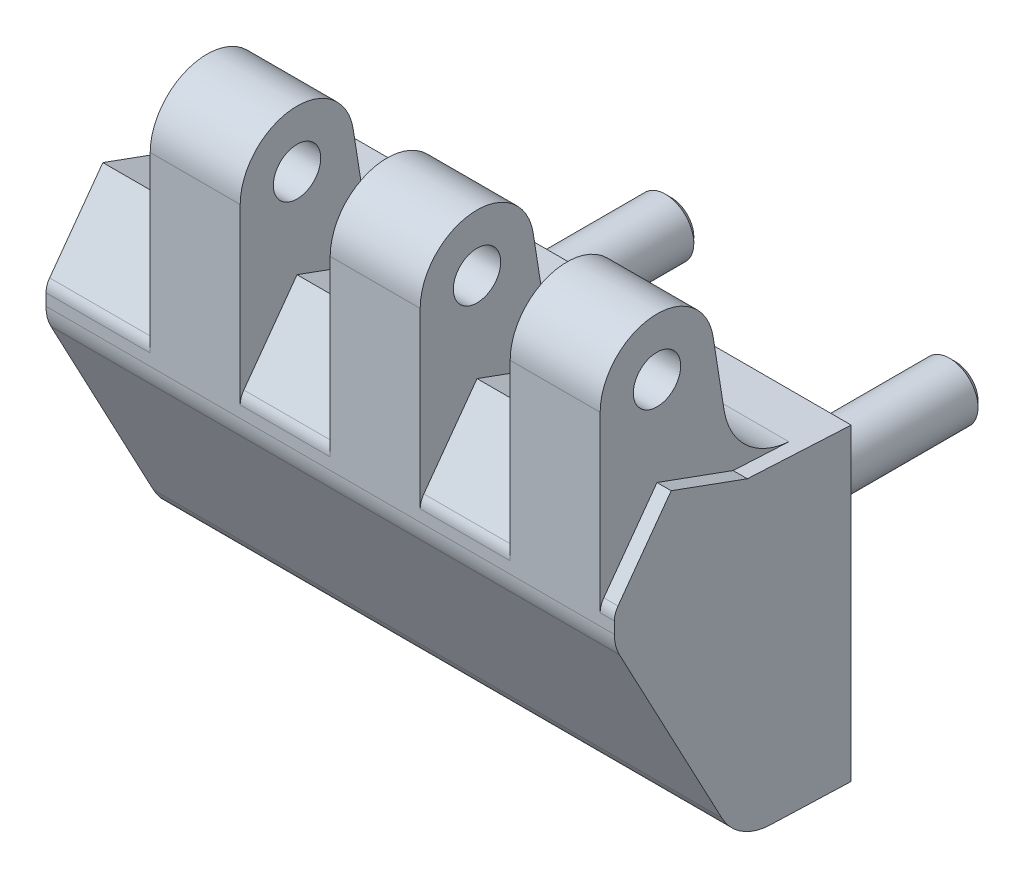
ISO-10303-21;
HEADER;
FILE_DESCRIPTION(('STEP AP214'),'2;1');
FILE_NAME('part.step','',(''),(''),'','','');
FILE_SCHEMA(('AUTOMOTIVE_DESIGN { 1 0 10303 214 1 1 1 1 }'));
ENDSEC;
DATA;
#1=APPLICATION_CONTEXT('core data for automotive mechanical design processes');
#2=APPLICATION_PROTOCOL_DEFINITION('international standard','automotive_design',2000,#1);
#3=PRODUCT_CONTEXT('',#1,'mechanical');
#4=PRODUCT('Part','Part','',(#3));
#5=PRODUCT_RELATED_PRODUCT_CATEGORY('part','',(#4));
#6=PRODUCT_DEFINITION_FORMATION('','',#4);
#7=PRODUCT_DEFINITION_CONTEXT('part definition',#1,'design');
#8=PRODUCT_DEFINITION('design','',#6,#7);
#9=PRODUCT_DEFINITION_SHAPE('','',#8);
#10=(LENGTH_UNIT() NAMED_UNIT(*) SI_UNIT(.MILLI.,.METRE.));
#11=(NAMED_UNIT(*) PLANE_ANGLE_UNIT() SI_UNIT($,.RADIAN.));
#12=(NAMED_UNIT(*) SI_UNIT($,.STERADIAN.) SOLID_ANGLE_UNIT());
#13=UNCERTAINTY_MEASURE_WITH_UNIT(LENGTH_MEASURE(1.E-05),#10,'distance_accuracy_value','');
#14=(GEOMETRIC_REPRESENTATION_CONTEXT(3) GLOBAL_UNCERTAINTY_ASSIGNED_CONTEXT((#13)) GLOBAL_UNIT_ASSIGNED_CONTEXT((#10,
#11,#12)) REPRESENTATION_CONTEXT('',''));
#15=CARTESIAN_POINT('',(0.,0.,0.));
#16=DIRECTION('',(0.,0.,1.));
#17=DIRECTION('',(1.,0.,0.));
#18=AXIS2_PLACEMENT_3D('',#15,#16,#17);
#19=CARTESIAN_POINT('',(-7.75,8.54,0.));
#20=DIRECTION('',(0.,0.998629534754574,-0.0523359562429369));
#21=DIRECTION('',(0.,0.0523359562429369,0.998629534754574));
#22=AXIS2_PLACEMENT_3D('',#19,#20,#21);
#23=PLANE('',#22);
#24=DIRECTION('',(1.,0.,0.));
#25=VECTOR('',#24,1.);
#26=CARTESIAN_POINT('',(-7.75,8.54,0.));
#27=LINE('',#26,#25);
#28=CARTESIAN_POINT('',(-7.5,8.54,0.));
#29=VERTEX_POINT('',#28);
#30=CARTESIAN_POINT('',(22.5,8.54,0.));
#31=VERTEX_POINT('',#30);
#32=EDGE_CURVE('E259',#29,#31,#27,.T.);
#33=ORIENTED_EDGE('',*,*,#32,.F.);
#34=DIRECTION('',(0.,-0.0523359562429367,-0.998629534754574));
#35=VECTOR('',#34,1.);
#36=CARTESIAN_POINT('',(-7.5,8.8272543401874,5.4811393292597));
#37=LINE('',#36,#35);
#38=CARTESIAN_POINT('',(-7.5,8.8272543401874,5.4811393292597));
#39=VERTEX_POINT('',#38);
#40=EDGE_CURVE('E241',#39,#29,#37,.T.);
#41=ORIENTED_EDGE('',*,*,#40,.F.);
#42=DIRECTION('',(1.,0.,0.));
#43=VECTOR('',#42,1.);
#44=CARTESIAN_POINT('',(-7.75,8.8272543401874,5.4811393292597));
#45=LINE('',#44,#43);
#46=CARTESIAN_POINT('',(-2.,8.8272543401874,5.4811393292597));
#47=VERTEX_POINT('',#46);
#48=EDGE_CURVE('E263',#39,#47,#45,.T.);
#49=ORIENTED_EDGE('',*,*,#48,.T.);
#50=DIRECTION('',(0.,0.0523359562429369,0.998629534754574));
#51=VECTOR('',#50,1.);
#52=CARTESIAN_POINT('',(-2.,8.54,0.));
#53=LINE('',#52,#51);
#54=CARTESIAN_POINT('',(-2.,8.67304490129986,2.53864794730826));
#55=VERTEX_POINT('',#54);
#56=EDGE_CURVE('E1156',#55,#47,#53,.T.);
#57=ORIENTED_EDGE('',*,*,#56,.F.);
#58=DIRECTION('',(1.,0.,0.));
#59=VECTOR('',#58,1.);
#60=CARTESIAN_POINT('',(-2.,8.67304490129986,2.53864794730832));
#61=LINE('',#60,#59);
#62=CARTESIAN_POINT('',(2.75,8.67304490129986,2.53864794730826));
#63=VERTEX_POINT('',#62);
#64=EDGE_CURVE('E261',#63,#55,#61,.F.);
#65=ORIENTED_EDGE('',*,*,#64,.F.);
#66=DIRECTION('',(0.,0.0523359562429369,0.998629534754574));
#67=VECTOR('',#66,1.);
#68=CARTESIAN_POINT('',(2.75,8.54,0.));
#69=LINE('',#68,#67);
#70=CARTESIAN_POINT('',(2.75,8.8272543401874,5.4811393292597));
#71=VERTEX_POINT('',#70);
#72=EDGE_CURVE('E1284',#63,#71,#69,.T.);
#73=ORIENTED_EDGE('',*,*,#72,.T.);
#74=CARTESIAN_POINT('',(7.5,8.8272543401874,5.4811393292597));
#75=VERTEX_POINT('',#74);
#76=EDGE_CURVE('E1225',#71,#75,#45,.T.);
#77=ORIENTED_EDGE('',*,*,#76,.T.);
#78=DIRECTION('',(0.,0.0523359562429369,0.998629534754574));
#79=VECTOR('',#78,1.);
#80=CARTESIAN_POINT('',(7.5,8.54,0.));
#81=LINE('',#80,#79);
#82=CARTESIAN_POINT('',(7.5,8.67304490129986,2.53864794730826));
#83=VERTEX_POINT('',#82);
#84=EDGE_CURVE('E1193',#83,#75,#81,.T.);
#85=ORIENTED_EDGE('',*,*,#84,.F.);
#86=DIRECTION('',(-1.,0.,0.));
#87=VECTOR('',#86,1.);
#88=CARTESIAN_POINT('',(12.25,8.67304490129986,2.53864794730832));
#89=LINE('',#88,#87);
#90=CARTESIAN_POINT('',(12.25,8.67304490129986,2.53864794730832));
#91=VERTEX_POINT('',#90);
#92=EDGE_CURVE('E258',#83,#91,#89,.F.);
#93=ORIENTED_EDGE('',*,*,#92,.T.);
#94=DIRECTION('',(0.,0.0523359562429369,0.998629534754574));
#95=VECTOR('',#94,1.);
#96=CARTESIAN_POINT('',(12.25,8.54,0.));
#97=LINE('',#96,#95);
#98=CARTESIAN_POINT('',(12.25,8.8272543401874,5.4811393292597));
#99=VERTEX_POINT('',#98);
#100=EDGE_CURVE('E1202',#91,#99,#97,.T.);
#101=ORIENTED_EDGE('',*,*,#100,.T.);
#102=CARTESIAN_POINT('',(17.,8.8272543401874,5.4811393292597));
#103=VERTEX_POINT('',#102);
#104=EDGE_CURVE('E1226',#99,#103,#45,.T.);
#105=ORIENTED_EDGE('',*,*,#104,.T.);
#106=DIRECTION('',(0.,0.0523359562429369,0.998629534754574));
#107=VECTOR('',#106,1.);
#108=CARTESIAN_POINT('',(17.,8.54,0.));
#109=LINE('',#108,#107);
#110=CARTESIAN_POINT('',(17.,8.67304490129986,2.53864794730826));
#111=VERTEX_POINT('',#110);
#112=EDGE_CURVE('E1233',#111,#103,#109,.T.);
#113=ORIENTED_EDGE('',*,*,#112,.F.);
#114=DIRECTION('',(-1.,0.,0.));
#115=VECTOR('',#114,1.);
#116=CARTESIAN_POINT('',(21.75,8.67304490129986,2.53864794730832));
#117=LINE('',#116,#115);
#118=CARTESIAN_POINT('',(21.75,8.67304490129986,2.53864794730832));
#119=VERTEX_POINT('',#118);
#120=EDGE_CURVE('E268',#111,#119,#117,.F.);
#121=ORIENTED_EDGE('',*,*,#120,.T.);
#122=DIRECTION('',(0.,0.0523359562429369,0.998629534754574));
#123=VECTOR('',#122,1.);
#124=CARTESIAN_POINT('',(21.75,8.54,0.));
#125=LINE('',#124,#123);
#126=CARTESIAN_POINT('',(21.75,8.8272543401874,5.4811393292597));
#127=VERTEX_POINT('',#126);
#128=EDGE_CURVE('E1114',#119,#127,#125,.T.);
#129=ORIENTED_EDGE('',*,*,#128,.T.);
#130=CARTESIAN_POINT('',(22.5,8.8272543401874,5.4811393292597));
#131=VERTEX_POINT('',#130);
#132=EDGE_CURVE('E1222',#127,#131,#45,.T.);
#133=ORIENTED_EDGE('',*,*,#132,.T.);
#134=DIRECTION('',(0.,0.0523359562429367,0.998629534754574));
#135=VECTOR('',#134,1.);
#136=CARTESIAN_POINT('',(22.5,8.54,0.));
#137=LINE('',#136,#135);
#138=EDGE_CURVE('E1403',#31,#131,#137,.T.);
#139=ORIENTED_EDGE('',*,*,#138,.F.);
#140=EDGE_LOOP('',(#33,#41,#49,#57,#65,#73,#77,#85,#93,#101,#105,#113,#121,#129,#133,#139));
#141=FACE_BOUND('',#140,.T.);
#142=ADVANCED_FACE('F14',(#141),#23,.T.);
#143=CARTESIAN_POINT('',(-7.75,-7.600480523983,4.2816775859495));
#144=DIRECTION('',(0.,-0.999390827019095,0.0348994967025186));
#145=DIRECTION('',(0.,-0.0348994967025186,-0.999390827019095));
#146=AXIS2_PLACEMENT_3D('',#143,#144,#145);
#147=PLANE('',#146);
#148=DIRECTION('',(1.,0.,0.));
#149=VECTOR('',#148,1.);
#150=CARTESIAN_POINT('',(-7.75,-7.600480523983,4.2816775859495));
#151=LINE('',#150,#149);
#152=CARTESIAN_POINT('',(-7.5,-7.600480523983,4.2816775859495));
#153=VERTEX_POINT('',#152);
#154=CARTESIAN_POINT('',(22.5,-7.600480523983,4.2816775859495));
#155=VERTEX_POINT('',#154);
#156=EDGE_CURVE('E251',#153,#155,#151,.T.);
#157=ORIENTED_EDGE('',*,*,#156,.F.);
#158=DIRECTION('',(0.,0.0348994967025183,0.999390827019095));
#159=VECTOR('',#158,1.);
#160=CARTESIAN_POINT('',(-7.5,-7.75,0.));
#161=LINE('',#160,#159);
#162=CARTESIAN_POINT('',(-7.5,-7.75,0.));
#163=VERTEX_POINT('',#162);
#164=EDGE_CURVE('E238',#163,#153,#161,.T.);
#165=ORIENTED_EDGE('',*,*,#164,.F.);
#166=DIRECTION('',(1.,0.,0.));
#167=VECTOR('',#166,1.);
#168=CARTESIAN_POINT('',(-7.75,-7.75,0.));
#169=LINE('',#168,#167);
#170=CARTESIAN_POINT('',(22.5,-7.75,0.));
#171=VERTEX_POINT('',#170);
#172=EDGE_CURVE('E249',#163,#171,#169,.T.);
#173=ORIENTED_EDGE('',*,*,#172,.T.);
#174=DIRECTION('',(0.,-0.0348994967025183,-0.999390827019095));
#175=VECTOR('',#174,1.);
#176=CARTESIAN_POINT('',(22.5,-7.600480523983,4.2816775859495));
#177=LINE('',#176,#175);
#178=EDGE_CURVE('E1406',#155,#171,#177,.T.);
#179=ORIENTED_EDGE('',*,*,#178,.F.);
#180=EDGE_LOOP('',(#157,#165,#173,#179));
#181=FACE_BOUND('',#180,.T.);
#182=ADVANCED_FACE('F16',(#181),#147,.T.);
#183=CARTESIAN_POINT('',(-7.75,-7.75,0.));
#184=DIRECTION('',(0.,0.,-1.));
#185=DIRECTION('',(-1.,0.,0.));
#186=AXIS2_PLACEMENT_3D('',#183,#184,#185);
#187=PLANE('',#186);
#188=CARTESIAN_POINT('',(0.,0.,0.));
#189=DIRECTION('',(0.,0.,-1.));
#190=DIRECTION('',(-1.,0.,0.));
#191=AXIS2_PLACEMENT_3D('',#188,#189,#190);
#192=CIRCLE('',#191,1.5);
#193=CARTESIAN_POINT('',(-1.5,0.,0.));
#194=VERTEX_POINT('',#193);
#195=EDGE_CURVE('E9',#194,#194,#192,.T.);
#196=ORIENTED_EDGE('',*,*,#195,.F.);
#197=EDGE_LOOP('',(#196));
#198=FACE_BOUND('',#197,.T.);
#199=CARTESIAN_POINT('',(15.,0.,0.));
#200=DIRECTION('',(0.,0.,-1.));
#201=DIRECTION('',(-1.,0.,0.));
#202=AXIS2_PLACEMENT_3D('',#199,#200,#201);
#203=CIRCLE('',#202,1.5);
#204=CARTESIAN_POINT('',(13.5,0.,0.));
#205=VERTEX_POINT('',#204);
#206=EDGE_CURVE('E22',#205,#205,#203,.T.);
#207=ORIENTED_EDGE('',*,*,#206,.F.);
#208=EDGE_LOOP('',(#207));
#209=FACE_BOUND('',#208,.T.);
#210=ORIENTED_EDGE('',*,*,#172,.F.);
#211=DIRECTION('',(0.,-1.,0.));
#212=VECTOR('',#211,1.);
#213=CARTESIAN_POINT('',(-7.5,8.54,0.));
#214=LINE('',#213,#212);
#215=EDGE_CURVE('E235',#29,#163,#214,.T.);
#216=ORIENTED_EDGE('',*,*,#215,.F.);
#217=ORIENTED_EDGE('',*,*,#32,.T.);
#218=DIRECTION('',(0.,1.,0.));
#219=VECTOR('',#218,1.);
#220=CARTESIAN_POINT('',(22.5,-7.75,0.));
#221=LINE('',#220,#219);
#222=EDGE_CURVE('E257',#171,#31,#221,.T.);
#223=ORIENTED_EDGE('',*,*,#222,.F.);
#224=EDGE_LOOP('',(#210,#216,#217,#223));
#225=FACE_BOUND('',#224,.T.);
#226=ADVANCED_FACE('F255',(#198,#209,#225),#187,.T.);
#227=CARTESIAN_POINT('',(-7.75,5.8359345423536,12.5));
#228=DIRECTION('',(0.,0.,1.));
#229=DIRECTION('',(1.,0.,0.));
#230=AXIS2_PLACEMENT_3D('',#227,#228,#229);
#231=PLANE('',#230);
#232=DIRECTION('',(1.,0.,0.));
#233=VECTOR('',#232,1.);
#234=CARTESIAN_POINT('',(-7.75,5.8359345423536,12.5));
#235=LINE('',#234,#233);
#236=CARTESIAN_POINT('',(-7.5,5.8359345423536,12.5));
#237=VERTEX_POINT('',#236);
#238=CARTESIAN_POINT('',(-2.,5.8359345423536,12.5));
#239=VERTEX_POINT('',#238);
#240=EDGE_CURVE('E1211',#237,#239,#235,.T.);
#241=ORIENTED_EDGE('',*,*,#240,.F.);
#242=DIRECTION('',(0.,1.,0.));
#243=VECTOR('',#242,1.);
#244=CARTESIAN_POINT('',(-7.5,5.22184224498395,12.5));
#245=LINE('',#244,#243);
#246=CARTESIAN_POINT('',(-7.5,5.22184224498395,12.5));
#247=VERTEX_POINT('',#246);
#248=EDGE_CURVE('E29',#247,#237,#245,.T.);
#249=ORIENTED_EDGE('',*,*,#248,.F.);
#250=DIRECTION('',(1.,0.,0.));
#251=VECTOR('',#250,1.);
#252=CARTESIAN_POINT('',(-7.75,5.2218422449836,12.5));
#253=LINE('',#252,#251);
#254=CARTESIAN_POINT('',(22.5,5.2218422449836,12.5));
#255=VERTEX_POINT('',#254);
#256=EDGE_CURVE('E1208',#247,#255,#253,.T.);
#257=ORIENTED_EDGE('',*,*,#256,.T.);
#258=DIRECTION('',(0.,-1.,0.));
#259=VECTOR('',#258,1.);
#260=CARTESIAN_POINT('',(22.5,5.8359345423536,12.5));
#261=LINE('',#260,#259);
#262=CARTESIAN_POINT('',(22.5,5.8359345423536,12.5));
#263=VERTEX_POINT('',#262);
#264=EDGE_CURVE('E1355',#263,#255,#261,.T.);
#265=ORIENTED_EDGE('',*,*,#264,.F.);
#266=CARTESIAN_POINT('',(21.75,5.8359345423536,12.5));
#267=VERTEX_POINT('',#266);
#268=EDGE_CURVE('E1210',#267,#263,#235,.T.);
#269=ORIENTED_EDGE('',*,*,#268,.F.);
#270=DIRECTION('',(0.,-1.,0.));
#271=VECTOR('',#270,1.);
#272=CARTESIAN_POINT('',(21.75,15.,12.5));
#273=LINE('',#272,#271);
#274=CARTESIAN_POINT('',(21.75,15.,12.5));
#275=VERTEX_POINT('',#274);
#276=EDGE_CURVE('E1090',#275,#267,#273,.T.);
#277=ORIENTED_EDGE('',*,*,#276,.F.);
#278=DIRECTION('',(-1.,0.,0.));
#279=VECTOR('',#278,1.);
#280=CARTESIAN_POINT('',(21.75,15.,12.5));
#281=LINE('',#280,#279);
#282=CARTESIAN_POINT('',(17.,15.,12.5));
#283=VERTEX_POINT('',#282);
#284=EDGE_CURVE('E1370',#275,#283,#281,.T.);
#285=ORIENTED_EDGE('',*,*,#284,.T.);
#286=DIRECTION('',(0.,-1.,0.));
#287=VECTOR('',#286,1.);
#288=CARTESIAN_POINT('',(17.,15.,12.5));
#289=LINE('',#288,#287);
#290=CARTESIAN_POINT('',(17.,5.8359345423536,12.5));
#291=VERTEX_POINT('',#290);
#292=EDGE_CURVE('E1103',#283,#291,#289,.T.);
#293=ORIENTED_EDGE('',*,*,#292,.T.);
#294=CARTESIAN_POINT('',(12.25,5.8359345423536,12.5));
#295=VERTEX_POINT('',#294);
#296=EDGE_CURVE('E1215',#295,#291,#235,.T.);
#297=ORIENTED_EDGE('',*,*,#296,.F.);
#298=DIRECTION('',(0.,-1.,0.));
#299=VECTOR('',#298,1.);
#300=CARTESIAN_POINT('',(12.25,15.,12.5));
#301=LINE('',#300,#299);
#302=CARTESIAN_POINT('',(12.25,15.,12.5));
#303=VERTEX_POINT('',#302);
#304=EDGE_CURVE('E1139',#303,#295,#301,.T.);
#305=ORIENTED_EDGE('',*,*,#304,.F.);
#306=DIRECTION('',(-1.,0.,0.));
#307=VECTOR('',#306,1.);
#308=CARTESIAN_POINT('',(12.25,15.,12.5));
#309=LINE('',#308,#307);
#310=CARTESIAN_POINT('',(7.5,15.,12.5));
#311=VERTEX_POINT('',#310);
#312=EDGE_CURVE('E1176',#303,#311,#309,.T.);
#313=ORIENTED_EDGE('',*,*,#312,.T.);
#314=DIRECTION('',(0.,-1.,0.));
#315=VECTOR('',#314,1.);
#316=CARTESIAN_POINT('',(7.5,15.,12.5));
#317=LINE('',#316,#315);
#318=CARTESIAN_POINT('',(7.5,5.8359345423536,12.5));
#319=VERTEX_POINT('',#318);
#320=EDGE_CURVE('E1152',#311,#319,#317,.T.);
#321=ORIENTED_EDGE('',*,*,#320,.T.);
#322=CARTESIAN_POINT('',(2.75,5.8359345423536,12.5));
#323=VERTEX_POINT('',#322);
#324=EDGE_CURVE('E1214',#323,#319,#235,.T.);
#325=ORIENTED_EDGE('',*,*,#324,.F.);
#326=DIRECTION('',(0.,-1.,0.));
#327=VECTOR('',#326,1.);
#328=CARTESIAN_POINT('',(2.75,15.,12.5));
#329=LINE('',#328,#327);
#330=CARTESIAN_POINT('',(2.75,15.,12.5));
#331=VERTEX_POINT('',#330);
#332=EDGE_CURVE('E1110',#331,#323,#329,.T.);
#333=ORIENTED_EDGE('',*,*,#332,.F.);
#334=DIRECTION('',(1.,0.,0.));
#335=VECTOR('',#334,1.);
#336=CARTESIAN_POINT('',(-2.,15.,12.5));
#337=LINE('',#336,#335);
#338=CARTESIAN_POINT('',(-2.,15.,12.5));
#339=VERTEX_POINT('',#338);
#340=EDGE_CURVE('E1268',#339,#331,#337,.T.);
#341=ORIENTED_EDGE('',*,*,#340,.F.);
#342=DIRECTION('',(0.,-1.,0.));
#343=VECTOR('',#342,1.);
#344=CARTESIAN_POINT('',(-2.,15.,12.5));
#345=LINE('',#344,#343);
#346=EDGE_CURVE('E1133',#339,#239,#345,.T.);
#347=ORIENTED_EDGE('',*,*,#346,.T.);
#348=EDGE_LOOP('',(#241,#249,#257,#265,#269,#277,#285,#293,#297,#305,#313,#321,#325,#333,#341,#347));
#349=FACE_BOUND('',#348,.T.);
#350=ADVANCED_FACE('F275',(#349),#231,.T.);
#351=CARTESIAN_POINT('',(-7.75,5.22184224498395,10.2499999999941));
#352=DIRECTION('',(1.,0.,0.));
#353=DIRECTION('',(0.,1.,0.));
#354=AXIS2_PLACEMENT_3D('',#351,#352,#353);
#355=CYLINDRICAL_SURFACE('',#354,2.2500000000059);
#356=ORIENTED_EDGE('',*,*,#256,.F.);
#357=CARTESIAN_POINT('',(-7.5,5.22184224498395,10.2499999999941));
#358=DIRECTION('',(-1.,0.,0.));
#359=DIRECTION('',(0.,0.,1.));
#360=AXIS2_PLACEMENT_3D('',#357,#358,#359);
#361=CIRCLE('',#360,2.2500000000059);
#362=CARTESIAN_POINT('',(-7.5,4.165531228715,12.236632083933));
#363=VERTEX_POINT('',#362);
#364=EDGE_CURVE('E1417',#363,#247,#361,.T.);
#365=ORIENTED_EDGE('',*,*,#364,.F.);
#366=DIRECTION('',(1.,0.,0.));
#367=VECTOR('',#366,1.);
#368=CARTESIAN_POINT('',(-7.75,4.165531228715,12.236632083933));
#369=LINE('',#368,#367);
#370=CARTESIAN_POINT('',(22.5,4.165531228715,12.236632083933));
#371=VERTEX_POINT('',#370);
#372=EDGE_CURVE('E1206',#363,#371,#369,.T.);
#373=ORIENTED_EDGE('',*,*,#372,.T.);
#374=CARTESIAN_POINT('',(22.5,5.22184224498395,10.2499999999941));
#375=DIRECTION('',(1.,0.,0.));
#376=DIRECTION('',(0.,0.,-1.));
#377=AXIS2_PLACEMENT_3D('',#374,#375,#376);
#378=CIRCLE('',#377,2.2500000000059);
#379=EDGE_CURVE('E1395',#255,#371,#378,.T.);
#380=ORIENTED_EDGE('',*,*,#379,.F.);
#381=EDGE_LOOP('',(#356,#365,#373,#380));
#382=FACE_BOUND('',#381,.T.);
#383=ADVANCED_FACE('F283',(#382),#355,.T.);
#384=CARTESIAN_POINT('',(-7.75,4.165531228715,12.236632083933));
#385=DIRECTION('',(0.,-0.469471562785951,0.882947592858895));
#386=DIRECTION('',(0.,-0.882947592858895,-0.469471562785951));
#387=AXIS2_PLACEMENT_3D('',#384,#385,#386);
#388=PLANE('',#387);
#389=ORIENTED_EDGE('',*,*,#372,.F.);
#390=DIRECTION('',(0.,0.882947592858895,0.469471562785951));
#391=VECTOR('',#390,1.);
#392=CARTESIAN_POINT('',(-7.5,-6.010722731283,6.8258218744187));
#393=LINE('',#392,#391);
#394=CARTESIAN_POINT('',(-7.5,-6.010722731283,6.82582187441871));
#395=VERTEX_POINT('',#394);
#396=EDGE_CURVE('E1419',#395,#363,#393,.T.);
#397=ORIENTED_EDGE('',*,*,#396,.F.);
#398=DIRECTION('',(1.,0.,0.));
#399=VECTOR('',#398,1.);
#400=CARTESIAN_POINT('',(-7.75,-6.010722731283,6.8258218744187));
#401=LINE('',#400,#399);
#402=CARTESIAN_POINT('',(22.5,-6.010722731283,6.8258218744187));
#403=VERTEX_POINT('',#402);
#404=EDGE_CURVE('E37',#395,#403,#401,.T.);
#405=ORIENTED_EDGE('',*,*,#404,.T.);
#406=DIRECTION('',(0.,-0.882947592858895,-0.469471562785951));
#407=VECTOR('',#406,1.);
#408=CARTESIAN_POINT('',(22.5,4.165531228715,12.236632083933));
#409=LINE('',#408,#407);
#410=EDGE_CURVE('E1393',#371,#403,#409,.T.);
#411=ORIENTED_EDGE('',*,*,#410,.F.);
#412=EDGE_LOOP('',(#389,#397,#405,#411));
#413=FACE_BOUND('',#412,.T.);
#414=ADVANCED_FACE('F315',(#413),#388,.T.);
#415=CARTESIAN_POINT('',(-7.75,-4.60230804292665,4.1769790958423));
#416=DIRECTION('',(1.,0.,0.));
#417=DIRECTION('',(0.,1.,0.));
#418=AXIS2_PLACEMENT_3D('',#415,#416,#417);
#419=CYLINDRICAL_SURFACE('',#418,2.99999999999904);
#420=ORIENTED_EDGE('',*,*,#404,.F.);
#421=CARTESIAN_POINT('',(-7.5,-4.60230804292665,4.1769790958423));
#422=DIRECTION('',(-1.,0.,0.));
#423=DIRECTION('',(0.,0.,1.));
#424=AXIS2_PLACEMENT_3D('',#421,#422,#423);
#425=CIRCLE('',#424,2.99999999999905);
#426=EDGE_CURVE('E252',#153,#395,#425,.T.);
#427=ORIENTED_EDGE('',*,*,#426,.F.);
#428=ORIENTED_EDGE('',*,*,#156,.T.);
#429=CARTESIAN_POINT('',(22.5,-4.60230804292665,4.1769790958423));
#430=DIRECTION('',(1.,0.,0.));
#431=DIRECTION('',(0.,0.,-1.));
#432=AXIS2_PLACEMENT_3D('',#429,#430,#431);
#433=CIRCLE('',#432,2.99999999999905);
#434=EDGE_CURVE('E1408',#403,#155,#433,.T.);
#435=ORIENTED_EDGE('',*,*,#434,.F.);
#436=EDGE_LOOP('',(#420,#427,#428,#435));
#437=FACE_BOUND('',#436,.T.);
#438=ADVANCED_FACE('F298',(#437),#419,.T.);
#439=CARTESIAN_POINT('',(-7.75,8.8272543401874,5.4811393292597));
#440=DIRECTION('',(0.,0.939692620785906,-0.342020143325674));
#441=DIRECTION('',(0.,0.342020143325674,0.939692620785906));
#442=AXIS2_PLACEMENT_3D('',#439,#440,#441);
#443=PLANE('',#442);
#444=ORIENTED_EDGE('',*,*,#48,.F.);
#445=DIRECTION('',(0.,-0.342020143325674,-0.939692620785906));
#446=VECTOR('',#445,1.);
#447=CARTESIAN_POINT('',(-7.5,10.29,9.5));
#448=LINE('',#447,#446);
#449=CARTESIAN_POINT('',(-7.5,10.29,9.5));
#450=VERTEX_POINT('',#449);
#451=EDGE_CURVE('E1412',#450,#39,#448,.T.);
#452=ORIENTED_EDGE('',*,*,#451,.F.);
#453=DIRECTION('',(1.,0.,0.));
#454=VECTOR('',#453,1.);
#455=CARTESIAN_POINT('',(-7.75,10.29,9.5));
#456=LINE('',#455,#454);
#457=CARTESIAN_POINT('',(-2.,10.29,9.5));
#458=VERTEX_POINT('',#457);
#459=EDGE_CURVE('E1221',#450,#458,#456,.T.);
#460=ORIENTED_EDGE('',*,*,#459,.T.);
#461=DIRECTION('',(0.,0.342020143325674,0.939692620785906));
#462=VECTOR('',#461,1.);
#463=CARTESIAN_POINT('',(-2.,8.8272543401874,5.4811393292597));
#464=LINE('',#463,#462);
#465=EDGE_CURVE('E1162',#47,#458,#464,.T.);
#466=ORIENTED_EDGE('',*,*,#465,.F.);
#467=EDGE_LOOP('',(#444,#452,#460,#466));
#468=FACE_BOUND('',#467,.T.);
#469=ADVANCED_FACE('F294',(#468),#443,.T.);
#470=CARTESIAN_POINT('',(-7.75,10.29,9.5));
#471=DIRECTION('',(0.,0.587785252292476,0.809016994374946));
#472=DIRECTION('',(0.,-0.809016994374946,0.587785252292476));
#473=AXIS2_PLACEMENT_3D('',#470,#471,#472);
#474=PLANE('',#473);
#475=ORIENTED_EDGE('',*,*,#459,.F.);
#476=DIRECTION('',(0.,0.809016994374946,-0.587785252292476));
#477=VECTOR('',#476,1.);
#478=CARTESIAN_POINT('',(-7.5,6.423719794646,12.309016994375));
#479=LINE('',#478,#477);
#480=CARTESIAN_POINT('',(-7.5,6.423719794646,12.309016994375));
#481=VERTEX_POINT('',#480);
#482=EDGE_CURVE('E1302',#481,#450,#479,.T.);
#483=ORIENTED_EDGE('',*,*,#482,.F.);
#484=DIRECTION('',(1.,0.,0.));
#485=VECTOR('',#484,1.);
#486=CARTESIAN_POINT('',(-7.75,6.423719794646,12.309016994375));
#487=LINE('',#486,#485);
#488=CARTESIAN_POINT('',(-2.,6.423719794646,12.309016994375));
#489=VERTEX_POINT('',#488);
#490=EDGE_CURVE('E1216',#481,#489,#487,.T.);
#491=ORIENTED_EDGE('',*,*,#490,.T.);
#492=DIRECTION('',(0.,-0.809016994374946,0.587785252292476));
#493=VECTOR('',#492,1.);
#494=CARTESIAN_POINT('',(-2.,10.29,9.5));
#495=LINE('',#494,#493);
#496=EDGE_CURVE('E1290',#458,#489,#495,.T.);
#497=ORIENTED_EDGE('',*,*,#496,.F.);
#498=EDGE_LOOP('',(#475,#483,#491,#497));
#499=FACE_BOUND('',#498,.T.);
#500=ADVANCED_FACE('F297',(#499),#474,.T.);
#501=CARTESIAN_POINT('',(-7.75,5.83593454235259,11.4999999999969));
#502=DIRECTION('',(1.,0.,0.));
#503=DIRECTION('',(0.,1.,0.));
#504=AXIS2_PLACEMENT_3D('',#501,#502,#503);
#505=CYLINDRICAL_SURFACE('',#504,1.00000000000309);
#506=ORIENTED_EDGE('',*,*,#490,.F.);
#507=CARTESIAN_POINT('',(-7.5,5.83593454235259,11.4999999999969));
#508=DIRECTION('',(-1.,0.,0.));
#509=DIRECTION('',(0.,0.,1.));
#510=AXIS2_PLACEMENT_3D('',#507,#508,#509);
#511=CIRCLE('',#510,1.0000000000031);
#512=EDGE_CURVE('E1303',#237,#481,#511,.T.);
#513=ORIENTED_EDGE('',*,*,#512,.F.);
#514=ORIENTED_EDGE('',*,*,#240,.T.);
#515=CARTESIAN_POINT('',(-2.,5.83593454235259,11.4999999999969));
#516=DIRECTION('',(-1.,0.,0.));
#517=DIRECTION('',(0.,-1.,0.));
#518=AXIS2_PLACEMENT_3D('',#515,#516,#517);
#519=CIRCLE('',#518,1.00000000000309);
#520=EDGE_CURVE('E1287',#489,#239,#519,.F.);
#521=ORIENTED_EDGE('',*,*,#520,.F.);
#522=EDGE_LOOP('',(#506,#513,#514,#521));
#523=FACE_BOUND('',#522,.T.);
#524=ADVANCED_FACE('F304',(#523),#505,.T.);
#525=CARTESIAN_POINT('',(21.75,10.29,9.5));
#526=VERTEX_POINT('',#525);
#527=CARTESIAN_POINT('',(22.5,10.29,9.5));
#528=VERTEX_POINT('',#527);
#529=EDGE_CURVE('E1218',#526,#528,#456,.T.);
#530=ORIENTED_EDGE('',*,*,#529,.T.);
#531=DIRECTION('',(0.,0.342020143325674,0.939692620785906));
#532=VECTOR('',#531,1.);
#533=CARTESIAN_POINT('',(22.5,8.8272543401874,5.4811393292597));
#534=LINE('',#533,#532);
#535=EDGE_CURVE('E1337',#131,#528,#534,.T.);
#536=ORIENTED_EDGE('',*,*,#535,.F.);
#537=ORIENTED_EDGE('',*,*,#132,.F.);
#538=DIRECTION('',(0.,0.342020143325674,0.939692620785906));
#539=VECTOR('',#538,1.);
#540=CARTESIAN_POINT('',(21.75,8.8272543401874,5.4811393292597));
#541=LINE('',#540,#539);
#542=EDGE_CURVE('E1252',#127,#526,#541,.T.);
#543=ORIENTED_EDGE('',*,*,#542,.T.);
#544=EDGE_LOOP('',(#530,#536,#537,#543));
#545=FACE_BOUND('',#544,.T.);
#546=ADVANCED_FACE('F300',(#545),#443,.T.);
#547=CARTESIAN_POINT('',(21.75,6.423719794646,12.309016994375));
#548=VERTEX_POINT('',#547);
#549=CARTESIAN_POINT('',(22.5,6.423719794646,12.309016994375));
#550=VERTEX_POINT('',#549);
#551=EDGE_CURVE('E1213',#548,#550,#487,.T.);
#552=ORIENTED_EDGE('',*,*,#551,.T.);
#553=DIRECTION('',(0.,-0.809016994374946,0.587785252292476));
#554=VECTOR('',#553,1.);
#555=CARTESIAN_POINT('',(22.5,10.29,9.5));
#556=LINE('',#555,#554);
#557=EDGE_CURVE('E1343',#528,#550,#556,.T.);
#558=ORIENTED_EDGE('',*,*,#557,.F.);
#559=ORIENTED_EDGE('',*,*,#529,.F.);
#560=DIRECTION('',(0.,-0.809016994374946,0.587785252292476));
#561=VECTOR('',#560,1.);
#562=CARTESIAN_POINT('',(21.75,10.29,9.5));
#563=LINE('',#562,#561);
#564=EDGE_CURVE('E1245',#526,#548,#563,.T.);
#565=ORIENTED_EDGE('',*,*,#564,.T.);
#566=EDGE_LOOP('',(#552,#558,#559,#565));
#567=FACE_BOUND('',#566,.T.);
#568=ADVANCED_FACE('F306',(#567),#474,.T.);
#569=ORIENTED_EDGE('',*,*,#268,.T.);
#570=CARTESIAN_POINT('',(22.5,5.83593454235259,11.4999999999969));
#571=DIRECTION('',(1.,0.,0.));
#572=DIRECTION('',(0.,0.,-1.));
#573=AXIS2_PLACEMENT_3D('',#570,#571,#572);
#574=CIRCLE('',#573,1.0000000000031);
#575=EDGE_CURVE('E1399',#550,#263,#574,.T.);
#576=ORIENTED_EDGE('',*,*,#575,.F.);
#577=ORIENTED_EDGE('',*,*,#551,.F.);
#578=CARTESIAN_POINT('',(21.75,5.83593454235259,11.4999999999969));
#579=DIRECTION('',(-1.,0.,0.));
#580=DIRECTION('',(0.,-1.,0.));
#581=AXIS2_PLACEMENT_3D('',#578,#579,#580);
#582=CIRCLE('',#581,1.00000000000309);
#583=EDGE_CURVE('E1243',#548,#267,#582,.F.);
#584=ORIENTED_EDGE('',*,*,#583,.T.);
#585=EDGE_LOOP('',(#569,#576,#577,#584));
#586=FACE_BOUND('',#585,.T.);
#587=ADVANCED_FACE('F310',(#586),#505,.T.);
#588=ORIENTED_EDGE('',*,*,#76,.F.);
#589=DIRECTION('',(0.,0.342020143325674,0.939692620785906));
#590=VECTOR('',#589,1.);
#591=CARTESIAN_POINT('',(2.75,8.8272543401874,5.4811393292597));
#592=LINE('',#591,#590);
#593=CARTESIAN_POINT('',(2.75,10.29,9.5));
#594=VERTEX_POINT('',#593);
#595=EDGE_CURVE('E1281',#71,#594,#592,.T.);
#596=ORIENTED_EDGE('',*,*,#595,.T.);
#597=CARTESIAN_POINT('',(7.5,10.29,9.5));
#598=VERTEX_POINT('',#597);
#599=EDGE_CURVE('E1223',#594,#598,#456,.T.);
#600=ORIENTED_EDGE('',*,*,#599,.T.);
#601=DIRECTION('',(0.,0.342020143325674,0.939692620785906));
#602=VECTOR('',#601,1.);
#603=CARTESIAN_POINT('',(7.5,8.8272543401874,5.4811393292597));
#604=LINE('',#603,#602);
#605=EDGE_CURVE('E1190',#75,#598,#604,.T.);
#606=ORIENTED_EDGE('',*,*,#605,.F.);
#607=EDGE_LOOP('',(#588,#596,#600,#606));
#608=FACE_BOUND('',#607,.T.);
#609=ADVANCED_FACE('F577',(#608),#443,.T.);
#610=ORIENTED_EDGE('',*,*,#599,.F.);
#611=DIRECTION('',(0.,-0.809016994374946,0.587785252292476));
#612=VECTOR('',#611,1.);
#613=CARTESIAN_POINT('',(2.75,10.29,9.5));
#614=LINE('',#613,#612);
#615=CARTESIAN_POINT('',(2.75,6.423719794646,12.309016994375));
#616=VERTEX_POINT('',#615);
#617=EDGE_CURVE('E1278',#594,#616,#614,.T.);
#618=ORIENTED_EDGE('',*,*,#617,.T.);
#619=CARTESIAN_POINT('',(7.5,6.423719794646,12.309016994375));
#620=VERTEX_POINT('',#619);
#621=EDGE_CURVE('E1219',#616,#620,#487,.T.);
#622=ORIENTED_EDGE('',*,*,#621,.T.);
#623=DIRECTION('',(0.,-0.809016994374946,0.587785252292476));
#624=VECTOR('',#623,1.);
#625=CARTESIAN_POINT('',(7.5,10.29,9.5));
#626=LINE('',#625,#624);
#627=EDGE_CURVE('E1187',#598,#620,#626,.T.);
#628=ORIENTED_EDGE('',*,*,#627,.F.);
#629=EDGE_LOOP('',(#610,#618,#622,#628));
#630=FACE_BOUND('',#629,.T.);
#631=ADVANCED_FACE('F569',(#630),#474,.T.);
#632=ORIENTED_EDGE('',*,*,#621,.F.);
#633=CARTESIAN_POINT('',(2.75,5.83593454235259,11.4999999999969));
#634=DIRECTION('',(-1.,0.,0.));
#635=DIRECTION('',(0.,-1.,0.));
#636=AXIS2_PLACEMENT_3D('',#633,#634,#635);
#637=CIRCLE('',#636,1.00000000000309);
#638=EDGE_CURVE('E1275',#616,#323,#637,.F.);
#639=ORIENTED_EDGE('',*,*,#638,.T.);
#640=ORIENTED_EDGE('',*,*,#324,.T.);
#641=CARTESIAN_POINT('',(7.5,5.83593454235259,11.4999999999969));
#642=DIRECTION('',(-1.,0.,0.));
#643=DIRECTION('',(0.,-1.,0.));
#644=AXIS2_PLACEMENT_3D('',#641,#642,#643);
#645=CIRCLE('',#644,1.00000000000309);
#646=EDGE_CURVE('E1184',#620,#319,#645,.F.);
#647=ORIENTED_EDGE('',*,*,#646,.F.);
#648=EDGE_LOOP('',(#632,#639,#640,#647));
#649=FACE_BOUND('',#648,.T.);
#650=ADVANCED_FACE('F561',(#649),#505,.T.);
#651=DIRECTION('',(0.,0.342020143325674,0.939692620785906));
#652=VECTOR('',#651,1.);
#653=CARTESIAN_POINT('',(17.,8.8272543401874,5.4811393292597));
#654=LINE('',#653,#652);
#655=CARTESIAN_POINT('',(17.,10.29,9.5));
#656=VERTEX_POINT('',#655);
#657=EDGE_CURVE('E1241',#103,#656,#654,.T.);
#658=ORIENTED_EDGE('',*,*,#657,.F.);
#659=ORIENTED_EDGE('',*,*,#104,.F.);
#660=DIRECTION('',(0.,0.342020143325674,0.939692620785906));
#661=VECTOR('',#660,1.);
#662=CARTESIAN_POINT('',(12.25,8.8272543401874,5.4811393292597));
#663=LINE('',#662,#661);
#664=CARTESIAN_POINT('',(12.25,10.29,9.5));
#665=VERTEX_POINT('',#664);
#666=EDGE_CURVE('E1200',#99,#665,#663,.T.);
#667=ORIENTED_EDGE('',*,*,#666,.T.);
#668=EDGE_CURVE('E1224',#665,#656,#456,.T.);
#669=ORIENTED_EDGE('',*,*,#668,.T.);
#670=EDGE_LOOP('',(#658,#659,#667,#669));
#671=FACE_BOUND('',#670,.T.);
#672=ADVANCED_FACE('F301',(#671),#443,.T.);
#673=DIRECTION('',(0.,-0.809016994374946,0.587785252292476));
#674=VECTOR('',#673,1.);
#675=CARTESIAN_POINT('',(17.,10.29,9.5));
#676=LINE('',#675,#674);
#677=CARTESIAN_POINT('',(17.,6.423719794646,12.309016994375));
#678=VERTEX_POINT('',#677);
#679=EDGE_CURVE('E1247',#656,#678,#676,.T.);
#680=ORIENTED_EDGE('',*,*,#679,.F.);
#681=ORIENTED_EDGE('',*,*,#668,.F.);
#682=DIRECTION('',(0.,-0.809016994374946,0.587785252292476));
#683=VECTOR('',#682,1.);
#684=CARTESIAN_POINT('',(12.25,10.29,9.5));
#685=LINE('',#684,#683);
#686=CARTESIAN_POINT('',(12.25,6.423719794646,12.309016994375));
#687=VERTEX_POINT('',#686);
#688=EDGE_CURVE('E1198',#665,#687,#685,.T.);
#689=ORIENTED_EDGE('',*,*,#688,.T.);
#690=EDGE_CURVE('E1220',#687,#678,#487,.T.);
#691=ORIENTED_EDGE('',*,*,#690,.T.);
#692=EDGE_LOOP('',(#680,#681,#689,#691));
#693=FACE_BOUND('',#692,.T.);
#694=ADVANCED_FACE('F307',(#693),#474,.T.);
#695=CARTESIAN_POINT('',(17.,5.83593454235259,11.4999999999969));
#696=DIRECTION('',(-1.,0.,0.));
#697=DIRECTION('',(0.,-1.,0.));
#698=AXIS2_PLACEMENT_3D('',#695,#696,#697);
#699=CIRCLE('',#698,1.00000000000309);
#700=EDGE_CURVE('E1361',#678,#291,#699,.F.);
#701=ORIENTED_EDGE('',*,*,#700,.F.);
#702=ORIENTED_EDGE('',*,*,#690,.F.);
#703=CARTESIAN_POINT('',(12.25,5.83593454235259,11.4999999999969));
#704=DIRECTION('',(-1.,0.,0.));
#705=DIRECTION('',(0.,-1.,0.));
#706=AXIS2_PLACEMENT_3D('',#703,#704,#705);
#707=CIRCLE('',#706,1.00000000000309);
#708=EDGE_CURVE('E1196',#687,#295,#707,.F.);
#709=ORIENTED_EDGE('',*,*,#708,.T.);
#710=ORIENTED_EDGE('',*,*,#296,.T.);
#711=EDGE_LOOP('',(#701,#702,#709,#710));
#712=FACE_BOUND('',#711,.T.);
#713=ADVANCED_FACE('F311',(#712),#505,.T.);
#714=CARTESIAN_POINT('',(12.25,12.4123793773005,2.25602155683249));
#715=DIRECTION('',(-1.,0.,0.));
#716=DIRECTION('',(0.,-1.,0.));
#717=AXIS2_PLACEMENT_3D('',#714,#715,#716);
#718=CYLINDRICAL_SURFACE('',#717,3.75000000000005);
#719=ORIENTED_EDGE('',*,*,#92,.F.);
#720=CARTESIAN_POINT('',(7.5,12.4123793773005,2.25602155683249));
#721=DIRECTION('',(-1.,0.,0.));
#722=DIRECTION('',(0.,1.,0.));
#723=AXIS2_PLACEMENT_3D('',#720,#721,#722);
#724=CIRCLE('',#723,3.75000000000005);
#725=CARTESIAN_POINT('',(7.5,11.8257501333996,5.9598528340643));
#726=VERTEX_POINT('',#725);
#727=EDGE_CURVE('E1148',#83,#726,#724,.T.);
#728=ORIENTED_EDGE('',*,*,#727,.T.);
#729=DIRECTION('',(-1.,0.,0.));
#730=VECTOR('',#729,1.);
#731=CARTESIAN_POINT('',(12.25,11.8257501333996,5.9598528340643));
#732=LINE('',#731,#730);
#733=CARTESIAN_POINT('',(12.25,11.8257501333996,5.9598528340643));
#734=VERTEX_POINT('',#733);
#735=EDGE_CURVE('E1181',#734,#726,#732,.T.);
#736=ORIENTED_EDGE('',*,*,#735,.F.);
#737=CARTESIAN_POINT('',(12.25,12.4123793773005,2.25602155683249));
#738=DIRECTION('',(-1.,0.,0.));
#739=DIRECTION('',(0.,1.,0.));
#740=AXIS2_PLACEMENT_3D('',#737,#738,#739);
#741=CIRCLE('',#740,3.75000000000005);
#742=EDGE_CURVE('E1165',#91,#734,#741,.T.);
#743=ORIENTED_EDGE('',*,*,#742,.F.);
#744=EDGE_LOOP('',(#719,#728,#736,#743));
#745=FACE_BOUND('',#744,.T.);
#746=ADVANCED_FACE('F322',(#745),#718,.F.);
#747=CARTESIAN_POINT('',(12.25,11.8257501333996,5.9598528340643));
#748=DIRECTION('',(0.,-0.156434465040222,0.987688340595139));
#749=DIRECTION('',(0.,-0.987688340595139,-0.156434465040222));
#750=AXIS2_PLACEMENT_3D('',#747,#748,#749);
#751=PLANE('',#750);
#752=DIRECTION('',(0.,0.987688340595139,0.156434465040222));
#753=VECTOR('',#752,1.);
#754=CARTESIAN_POINT('',(7.5,11.8257501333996,5.9598528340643));
#755=LINE('',#754,#753);
#756=CARTESIAN_POINT('',(7.5,15.4693033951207,6.5369349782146));
#757=VERTEX_POINT('',#756);
#758=EDGE_CURVE('E1144',#726,#757,#755,.T.);
#759=ORIENTED_EDGE('',*,*,#758,.T.);
#760=DIRECTION('',(-1.,0.,0.));
#761=VECTOR('',#760,1.);
#762=CARTESIAN_POINT('',(12.25,15.4693033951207,6.5369349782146));
#763=LINE('',#762,#761);
#764=CARTESIAN_POINT('',(12.25,15.4693033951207,6.5369349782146));
#765=VERTEX_POINT('',#764);
#766=EDGE_CURVE('E1178',#765,#757,#763,.T.);
#767=ORIENTED_EDGE('',*,*,#766,.F.);
#768=DIRECTION('',(0.,0.987688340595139,0.156434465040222));
#769=VECTOR('',#768,1.);
#770=CARTESIAN_POINT('',(12.25,11.8257501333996,5.9598528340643));
#771=LINE('',#770,#769);
#772=EDGE_CURVE('E1167',#734,#765,#771,.T.);
#773=ORIENTED_EDGE('',*,*,#772,.F.);
#774=ORIENTED_EDGE('',*,*,#735,.T.);
#775=EDGE_LOOP('',(#759,#767,#773,#774));
#776=FACE_BOUND('',#775,.T.);
#777=ADVANCED_FACE('F325',(#776),#751,.F.);
#778=CARTESIAN_POINT('',(12.25,15.,9.5));
#779=DIRECTION('',(-1.,0.,0.));
#780=DIRECTION('',(0.,-1.,0.));
#781=AXIS2_PLACEMENT_3D('',#778,#779,#780);
#782=CYLINDRICAL_SURFACE('',#781,3.);
#783=CARTESIAN_POINT('',(7.5,15.,9.5));
#784=DIRECTION('',(1.,0.,0.));
#785=DIRECTION('',(0.,-1.,0.));
#786=AXIS2_PLACEMENT_3D('',#783,#784,#785);
#787=CIRCLE('',#786,3.);
#788=EDGE_CURVE('E1140',#757,#311,#787,.T.);
#789=ORIENTED_EDGE('',*,*,#788,.T.);
#790=ORIENTED_EDGE('',*,*,#312,.F.);
#791=CARTESIAN_POINT('',(12.25,15.,9.5));
#792=DIRECTION('',(1.,0.,0.));
#793=DIRECTION('',(0.,-1.,0.));
#794=AXIS2_PLACEMENT_3D('',#791,#792,#793);
#795=CIRCLE('',#794,3.);
#796=EDGE_CURVE('E1169',#765,#303,#795,.T.);
#797=ORIENTED_EDGE('',*,*,#796,.F.);
#798=ORIENTED_EDGE('',*,*,#766,.T.);
#799=EDGE_LOOP('',(#789,#790,#797,#798));
#800=FACE_BOUND('',#799,.T.);
#801=ADVANCED_FACE('F329',(#800),#782,.T.);
#802=CARTESIAN_POINT('',(12.25,15.,9.5));
#803=DIRECTION('',(-1.,0.,0.));
#804=DIRECTION('',(0.,-1.,0.));
#805=AXIS2_PLACEMENT_3D('',#802,#803,#804);
#806=CYLINDRICAL_SURFACE('',#805,1.25);
#807=CARTESIAN_POINT('',(12.25,15.,9.5));
#808=DIRECTION('',(1.,0.,0.));
#809=DIRECTION('',(0.,1.,0.));
#810=AXIS2_PLACEMENT_3D('',#807,#808,#809);
#811=CIRCLE('',#810,1.25);
#812=CARTESIAN_POINT('',(12.25,16.25,9.5));
#813=VERTEX_POINT('',#812);
#814=EDGE_CURVE('E1171',#813,#813,#811,.T.);
#815=ORIENTED_EDGE('',*,*,#814,.T.);
#816=EDGE_LOOP('',(#815));
#817=FACE_BOUND('',#816,.T.);
#818=CARTESIAN_POINT('',(7.5,15.,9.5));
#819=DIRECTION('',(1.,0.,0.));
#820=DIRECTION('',(0.,1.,0.));
#821=AXIS2_PLACEMENT_3D('',#818,#819,#820);
#822=CIRCLE('',#821,1.25);
#823=CARTESIAN_POINT('',(7.5,16.25,9.5));
#824=VERTEX_POINT('',#823);
#825=EDGE_CURVE('E1135',#824,#824,#822,.T.);
#826=ORIENTED_EDGE('',*,*,#825,.F.);
#827=EDGE_LOOP('',(#826));
#828=FACE_BOUND('',#827,.T.);
#829=ADVANCED_FACE('F333',(#817,#828),#806,.F.);
#830=CARTESIAN_POINT('',(12.25,12.4123793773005,2.25602155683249));
#831=DIRECTION('',(-1.,0.,0.));
#832=DIRECTION('',(0.,-1.,0.));
#833=AXIS2_PLACEMENT_3D('',#830,#831,#832);
#834=PLANE('',#833);
#835=ORIENTED_EDGE('',*,*,#100,.F.);
#836=ORIENTED_EDGE('',*,*,#742,.T.);
#837=ORIENTED_EDGE('',*,*,#772,.T.);
#838=ORIENTED_EDGE('',*,*,#796,.T.);
#839=ORIENTED_EDGE('',*,*,#304,.T.);
#840=ORIENTED_EDGE('',*,*,#708,.F.);
#841=ORIENTED_EDGE('',*,*,#688,.F.);
#842=ORIENTED_EDGE('',*,*,#666,.F.);
#843=EDGE_LOOP('',(#835,#836,#837,#838,#839,#840,#841,#842));
#844=FACE_BOUND('',#843,.T.);
#845=ORIENTED_EDGE('',*,*,#814,.F.);
#846=EDGE_LOOP('',(#845));
#847=FACE_BOUND('',#846,.T.);
#848=ADVANCED_FACE('F337',(#844,#847),#834,.F.);
#849=CARTESIAN_POINT('',(7.5,12.4123793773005,2.25602155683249));
#850=DIRECTION('',(-1.,0.,0.));
#851=DIRECTION('',(0.,-1.,0.));
#852=AXIS2_PLACEMENT_3D('',#849,#850,#851);
#853=PLANE('',#852);
#854=ORIENTED_EDGE('',*,*,#727,.F.);
#855=ORIENTED_EDGE('',*,*,#84,.T.);
#856=ORIENTED_EDGE('',*,*,#605,.T.);
#857=ORIENTED_EDGE('',*,*,#627,.T.);
#858=ORIENTED_EDGE('',*,*,#646,.T.);
#859=ORIENTED_EDGE('',*,*,#320,.F.);
#860=ORIENTED_EDGE('',*,*,#788,.F.);
#861=ORIENTED_EDGE('',*,*,#758,.F.);
#862=EDGE_LOOP('',(#854,#855,#856,#857,#858,#859,#860,#861));
#863=FACE_BOUND('',#862,.T.);
#864=ORIENTED_EDGE('',*,*,#825,.T.);
#865=EDGE_LOOP('',(#864));
#866=FACE_BOUND('',#865,.T.);
#867=ADVANCED_FACE('F341',(#863,#866),#853,.T.);
#868=CARTESIAN_POINT('',(-2.,12.4123793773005,2.25602155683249));
#869=DIRECTION('',(1.,0.,0.));
#870=DIRECTION('',(0.,1.,0.));
#871=AXIS2_PLACEMENT_3D('',#868,#869,#870);
#872=CYLINDRICAL_SURFACE('',#871,3.75000000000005);
#873=CARTESIAN_POINT('',(2.75,12.4123793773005,2.25602155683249));
#874=DIRECTION('',(-1.,0.,0.));
#875=DIRECTION('',(0.,1.,0.));
#876=AXIS2_PLACEMENT_3D('',#873,#874,#875);
#877=CIRCLE('',#876,3.75000000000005);
#878=CARTESIAN_POINT('',(2.75,11.8257501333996,5.9598528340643));
#879=VERTEX_POINT('',#878);
#880=EDGE_CURVE('E1113',#63,#879,#877,.T.);
#881=ORIENTED_EDGE('',*,*,#880,.F.);
#882=ORIENTED_EDGE('',*,*,#64,.T.);
#883=CARTESIAN_POINT('',(-2.,12.4123793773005,2.25602155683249));
#884=DIRECTION('',(-1.,0.,0.));
#885=DIRECTION('',(0.,1.,0.));
#886=AXIS2_PLACEMENT_3D('',#883,#884,#885);
#887=CIRCLE('',#886,3.75000000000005);
#888=CARTESIAN_POINT('',(-2.,11.8257501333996,5.9598528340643));
#889=VERTEX_POINT('',#888);
#890=EDGE_CURVE('E1255',#55,#889,#887,.T.);
#891=ORIENTED_EDGE('',*,*,#890,.T.);
#892=DIRECTION('',(1.,0.,0.));
#893=VECTOR('',#892,1.);
#894=CARTESIAN_POINT('',(-2.,11.8257501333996,5.9598528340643));
#895=LINE('',#894,#893);
#896=EDGE_CURVE('E1272',#889,#879,#895,.T.);
#897=ORIENTED_EDGE('',*,*,#896,.T.);
#898=EDGE_LOOP('',(#881,#882,#891,#897));
#899=FACE_BOUND('',#898,.T.);
#900=ADVANCED_FACE('F345',(#899),#872,.F.);
#901=CARTESIAN_POINT('',(-2.,11.8257501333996,5.9598528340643));
#902=DIRECTION('',(0.,0.156434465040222,-0.987688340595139));
#903=DIRECTION('',(0.,0.987688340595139,0.156434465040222));
#904=AXIS2_PLACEMENT_3D('',#901,#902,#903);
#905=PLANE('',#904);
#906=DIRECTION('',(0.,0.987688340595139,0.156434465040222));
#907=VECTOR('',#906,1.);
#908=CARTESIAN_POINT('',(2.75,11.8257501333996,5.9598528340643));
#909=LINE('',#908,#907);
#910=CARTESIAN_POINT('',(2.75,15.4693033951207,6.5369349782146));
#911=VERTEX_POINT('',#910);
#912=EDGE_CURVE('E1121',#879,#911,#909,.T.);
#913=ORIENTED_EDGE('',*,*,#912,.F.);
#914=ORIENTED_EDGE('',*,*,#896,.F.);
#915=DIRECTION('',(0.,0.987688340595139,0.156434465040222));
#916=VECTOR('',#915,1.);
#917=CARTESIAN_POINT('',(-2.,11.8257501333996,5.9598528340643));
#918=LINE('',#917,#916);
#919=CARTESIAN_POINT('',(-2.,15.4693033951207,6.5369349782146));
#920=VERTEX_POINT('',#919);
#921=EDGE_CURVE('E1257',#889,#920,#918,.T.);
#922=ORIENTED_EDGE('',*,*,#921,.T.);
#923=DIRECTION('',(1.,0.,0.));
#924=VECTOR('',#923,1.);
#925=CARTESIAN_POINT('',(-2.,15.4693033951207,6.5369349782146));
#926=LINE('',#925,#924);
#927=EDGE_CURVE('E1270',#920,#911,#926,.T.);
#928=ORIENTED_EDGE('',*,*,#927,.T.);
#929=EDGE_LOOP('',(#913,#914,#922,#928));
#930=FACE_BOUND('',#929,.T.);
#931=ADVANCED_FACE('F349',(#930),#905,.T.);
#932=CARTESIAN_POINT('',(-2.,15.,9.5));
#933=DIRECTION('',(1.,0.,0.));
#934=DIRECTION('',(0.,1.,0.));
#935=AXIS2_PLACEMENT_3D('',#932,#933,#934);
#936=CYLINDRICAL_SURFACE('',#935,3.);
#937=CARTESIAN_POINT('',(2.75,15.,9.5));
#938=DIRECTION('',(1.,0.,0.));
#939=DIRECTION('',(0.,-1.,0.));
#940=AXIS2_PLACEMENT_3D('',#937,#938,#939);
#941=CIRCLE('',#940,3.);
#942=EDGE_CURVE('E1116',#911,#331,#941,.T.);
#943=ORIENTED_EDGE('',*,*,#942,.F.);
#944=ORIENTED_EDGE('',*,*,#927,.F.);
#945=CARTESIAN_POINT('',(-2.,15.,9.5));
#946=DIRECTION('',(1.,0.,0.));
#947=DIRECTION('',(0.,-1.,0.));
#948=AXIS2_PLACEMENT_3D('',#945,#946,#947);
#949=CIRCLE('',#948,3.);
#950=EDGE_CURVE('E1260',#920,#339,#949,.T.);
#951=ORIENTED_EDGE('',*,*,#950,.T.);
#952=ORIENTED_EDGE('',*,*,#340,.T.);
#953=EDGE_LOOP('',(#943,#944,#951,#952));
#954=FACE_BOUND('',#953,.T.);
#955=ADVANCED_FACE('F353',(#954),#936,.T.);
#956=CARTESIAN_POINT('',(-2.,15.,9.5));
#957=DIRECTION('',(1.,0.,0.));
#958=DIRECTION('',(0.,1.,0.));
#959=AXIS2_PLACEMENT_3D('',#956,#957,#958);
#960=CYLINDRICAL_SURFACE('',#959,1.25);
#961=CARTESIAN_POINT('',(-2.,15.,9.5));
#962=DIRECTION('',(1.,0.,0.));
#963=DIRECTION('',(0.,1.,0.));
#964=AXIS2_PLACEMENT_3D('',#961,#962,#963);
#965=CIRCLE('',#964,1.25);
#966=CARTESIAN_POINT('',(-2.,16.25,9.5));
#967=VERTEX_POINT('',#966);
#968=EDGE_CURVE('E1263',#967,#967,#965,.T.);
#969=ORIENTED_EDGE('',*,*,#968,.F.);
#970=EDGE_LOOP('',(#969));
#971=FACE_BOUND('',#970,.T.);
#972=CARTESIAN_POINT('',(2.75,15.,9.5));
#973=DIRECTION('',(1.,0.,0.));
#974=DIRECTION('',(0.,1.,0.));
#975=AXIS2_PLACEMENT_3D('',#972,#973,#974);
#976=CIRCLE('',#975,1.25);
#977=CARTESIAN_POINT('',(2.75,16.25,9.5));
#978=VERTEX_POINT('',#977);
#979=EDGE_CURVE('E1120',#978,#978,#976,.T.);
#980=ORIENTED_EDGE('',*,*,#979,.T.);
#981=EDGE_LOOP('',(#980));
#982=FACE_BOUND('',#981,.T.);
#983=ADVANCED_FACE('F357',(#971,#982),#960,.F.);
#984=CARTESIAN_POINT('',(-2.,12.4123793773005,2.25602155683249));
#985=DIRECTION('',(-1.,0.,0.));
#986=DIRECTION('',(0.,-1.,0.));
#987=AXIS2_PLACEMENT_3D('',#984,#985,#986);
#988=PLANE('',#987);
#989=ORIENTED_EDGE('',*,*,#890,.F.);
#990=ORIENTED_EDGE('',*,*,#56,.T.);
#991=ORIENTED_EDGE('',*,*,#465,.T.);
#992=ORIENTED_EDGE('',*,*,#496,.T.);
#993=ORIENTED_EDGE('',*,*,#520,.T.);
#994=ORIENTED_EDGE('',*,*,#346,.F.);
#995=ORIENTED_EDGE('',*,*,#950,.F.);
#996=ORIENTED_EDGE('',*,*,#921,.F.);
#997=EDGE_LOOP('',(#989,#990,#991,#992,#993,#994,#995,#996));
#998=FACE_BOUND('',#997,.T.);
#999=ORIENTED_EDGE('',*,*,#968,.T.);
#1000=EDGE_LOOP('',(#999));
#1001=FACE_BOUND('',#1000,.T.);
#1002=ADVANCED_FACE('F361',(#998,#1001),#988,.T.);
#1003=CARTESIAN_POINT('',(2.75,12.4123793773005,2.25602155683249));
#1004=DIRECTION('',(-1.,0.,0.));
#1005=DIRECTION('',(0.,-1.,0.));
#1006=AXIS2_PLACEMENT_3D('',#1003,#1004,#1005);
#1007=PLANE('',#1006);
#1008=ORIENTED_EDGE('',*,*,#72,.F.);
#1009=ORIENTED_EDGE('',*,*,#880,.T.);
#1010=ORIENTED_EDGE('',*,*,#912,.T.);
#1011=ORIENTED_EDGE('',*,*,#942,.T.);
#1012=ORIENTED_EDGE('',*,*,#332,.T.);
#1013=ORIENTED_EDGE('',*,*,#638,.F.);
#1014=ORIENTED_EDGE('',*,*,#617,.F.);
#1015=ORIENTED_EDGE('',*,*,#595,.F.);
#1016=EDGE_LOOP('',(#1008,#1009,#1010,#1011,#1012,#1013,#1014,#1015));
#1017=FACE_BOUND('',#1016,.T.);
#1018=ORIENTED_EDGE('',*,*,#979,.F.);
#1019=EDGE_LOOP('',(#1018));
#1020=FACE_BOUND('',#1019,.T.);
#1021=ADVANCED_FACE('F365',(#1017,#1020),#1007,.F.);
#1022=CARTESIAN_POINT('',(21.75,12.4123793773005,2.25602155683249));
#1023=DIRECTION('',(-1.,0.,0.));
#1024=DIRECTION('',(0.,-1.,0.));
#1025=AXIS2_PLACEMENT_3D('',#1022,#1023,#1024);
#1026=CYLINDRICAL_SURFACE('',#1025,3.75000000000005);
#1027=ORIENTED_EDGE('',*,*,#120,.F.);
#1028=CARTESIAN_POINT('',(17.,12.4123793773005,2.25602155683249));
#1029=DIRECTION('',(-1.,0.,0.));
#1030=DIRECTION('',(0.,1.,0.));
#1031=AXIS2_PLACEMENT_3D('',#1028,#1029,#1030);
#1032=CIRCLE('',#1031,3.75000000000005);
#1033=CARTESIAN_POINT('',(17.,11.8257501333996,5.9598528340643));
#1034=VERTEX_POINT('',#1033);
#1035=EDGE_CURVE('E1099',#111,#1034,#1032,.T.);
#1036=ORIENTED_EDGE('',*,*,#1035,.T.);
#1037=DIRECTION('',(-1.,0.,0.));
#1038=VECTOR('',#1037,1.);
#1039=CARTESIAN_POINT('',(21.75,11.8257501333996,5.9598528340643));
#1040=LINE('',#1039,#1038);
#1041=CARTESIAN_POINT('',(21.75,11.8257501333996,5.9598528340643));
#1042=VERTEX_POINT('',#1041);
#1043=EDGE_CURVE('E1362',#1042,#1034,#1040,.T.);
#1044=ORIENTED_EDGE('',*,*,#1043,.F.);
#1045=CARTESIAN_POINT('',(21.75,12.4123793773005,2.25602155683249));
#1046=DIRECTION('',(-1.,0.,0.));
#1047=DIRECTION('',(0.,1.,0.));
#1048=AXIS2_PLACEMENT_3D('',#1045,#1046,#1047);
#1049=CIRCLE('',#1048,3.75000000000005);
#1050=EDGE_CURVE('E1377',#119,#1042,#1049,.T.);
#1051=ORIENTED_EDGE('',*,*,#1050,.F.);
#1052=EDGE_LOOP('',(#1027,#1036,#1044,#1051));
#1053=FACE_BOUND('',#1052,.T.);
#1054=ADVANCED_FACE('F369',(#1053),#1026,.F.);
#1055=CARTESIAN_POINT('',(21.75,11.8257501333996,5.9598528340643));
#1056=DIRECTION('',(0.,-0.156434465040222,0.987688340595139));
#1057=DIRECTION('',(0.,-0.987688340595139,-0.156434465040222));
#1058=AXIS2_PLACEMENT_3D('',#1055,#1056,#1057);
#1059=PLANE('',#1058);
#1060=DIRECTION('',(0.,0.987688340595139,0.156434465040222));
#1061=VECTOR('',#1060,1.);
#1062=CARTESIAN_POINT('',(17.,11.8257501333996,5.9598528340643));
#1063=LINE('',#1062,#1061);
#1064=CARTESIAN_POINT('',(17.,15.4693033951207,6.5369349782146));
#1065=VERTEX_POINT('',#1064);
#1066=EDGE_CURVE('E1095',#1034,#1065,#1063,.T.);
#1067=ORIENTED_EDGE('',*,*,#1066,.T.);
#1068=DIRECTION('',(-1.,0.,0.));
#1069=VECTOR('',#1068,1.);
#1070=CARTESIAN_POINT('',(21.75,15.4693033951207,6.5369349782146));
#1071=LINE('',#1070,#1069);
#1072=CARTESIAN_POINT('',(21.75,15.4693033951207,6.5369349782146));
#1073=VERTEX_POINT('',#1072);
#1074=EDGE_CURVE('E1367',#1073,#1065,#1071,.T.);
#1075=ORIENTED_EDGE('',*,*,#1074,.F.);
#1076=DIRECTION('',(0.,0.987688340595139,0.156434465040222));
#1077=VECTOR('',#1076,1.);
#1078=CARTESIAN_POINT('',(21.75,11.8257501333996,5.9598528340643));
#1079=LINE('',#1078,#1077);
#1080=EDGE_CURVE('E1379',#1042,#1073,#1079,.T.);
#1081=ORIENTED_EDGE('',*,*,#1080,.F.);
#1082=ORIENTED_EDGE('',*,*,#1043,.T.);
#1083=EDGE_LOOP('',(#1067,#1075,#1081,#1082));
#1084=FACE_BOUND('',#1083,.T.);
#1085=ADVANCED_FACE('F373',(#1084),#1059,.F.);
#1086=CARTESIAN_POINT('',(21.75,15.,9.5));
#1087=DIRECTION('',(-1.,0.,0.));
#1088=DIRECTION('',(0.,-1.,0.));
#1089=AXIS2_PLACEMENT_3D('',#1086,#1087,#1088);
#1090=CYLINDRICAL_SURFACE('',#1089,3.);
#1091=CARTESIAN_POINT('',(17.,15.,9.5));
#1092=DIRECTION('',(1.,0.,0.));
#1093=DIRECTION('',(0.,-1.,0.));
#1094=AXIS2_PLACEMENT_3D('',#1091,#1092,#1093);
#1095=CIRCLE('',#1094,3.);
#1096=EDGE_CURVE('E1091',#1065,#283,#1095,.T.);
#1097=ORIENTED_EDGE('',*,*,#1096,.T.);
#1098=ORIENTED_EDGE('',*,*,#284,.F.);
#1099=CARTESIAN_POINT('',(21.75,15.,9.5));
#1100=DIRECTION('',(1.,0.,0.));
#1101=DIRECTION('',(0.,-1.,0.));
#1102=AXIS2_PLACEMENT_3D('',#1099,#1100,#1101);
#1103=CIRCLE('',#1102,3.);
#1104=EDGE_CURVE('E1375',#1073,#275,#1103,.T.);
#1105=ORIENTED_EDGE('',*,*,#1104,.F.);
#1106=ORIENTED_EDGE('',*,*,#1074,.T.);
#1107=EDGE_LOOP('',(#1097,#1098,#1105,#1106));
#1108=FACE_BOUND('',#1107,.T.);
#1109=ADVANCED_FACE('F377',(#1108),#1090,.T.);
#1110=CARTESIAN_POINT('',(21.75,15.,9.5));
#1111=DIRECTION('',(-1.,0.,0.));
#1112=DIRECTION('',(0.,-1.,0.));
#1113=AXIS2_PLACEMENT_3D('',#1110,#1111,#1112);
#1114=CYLINDRICAL_SURFACE('',#1113,1.25);
#1115=CARTESIAN_POINT('',(21.75,15.,9.5));
#1116=DIRECTION('',(1.,0.,0.));
#1117=DIRECTION('',(0.,1.,0.));
#1118=AXIS2_PLACEMENT_3D('',#1115,#1116,#1117);
#1119=CIRCLE('',#1118,1.25);
#1120=CARTESIAN_POINT('',(21.75,16.25,9.5));
#1121=VERTEX_POINT('',#1120);
#1122=EDGE_CURVE('E1372',#1121,#1121,#1119,.T.);
#1123=ORIENTED_EDGE('',*,*,#1122,.T.);
#1124=EDGE_LOOP('',(#1123));
#1125=FACE_BOUND('',#1124,.T.);
#1126=CARTESIAN_POINT('',(17.,15.,9.5));
#1127=DIRECTION('',(1.,0.,0.));
#1128=DIRECTION('',(0.,1.,0.));
#1129=AXIS2_PLACEMENT_3D('',#1126,#1127,#1128);
#1130=CIRCLE('',#1129,1.25);
#1131=CARTESIAN_POINT('',(17.,16.25,9.5));
#1132=VERTEX_POINT('',#1131);
#1133=EDGE_CURVE('E1086',#1132,#1132,#1130,.T.);
#1134=ORIENTED_EDGE('',*,*,#1133,.F.);
#1135=EDGE_LOOP('',(#1134));
#1136=FACE_BOUND('',#1135,.T.);
#1137=ADVANCED_FACE('F381',(#1125,#1136),#1114,.F.);
#1138=CARTESIAN_POINT('',(21.75,12.4123793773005,2.25602155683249));
#1139=DIRECTION('',(-1.,0.,0.));
#1140=DIRECTION('',(0.,-1.,0.));
#1141=AXIS2_PLACEMENT_3D('',#1138,#1139,#1140);
#1142=PLANE('',#1141);
#1143=ORIENTED_EDGE('',*,*,#128,.F.);
#1144=ORIENTED_EDGE('',*,*,#1050,.T.);
#1145=ORIENTED_EDGE('',*,*,#1080,.T.);
#1146=ORIENTED_EDGE('',*,*,#1104,.T.);
#1147=ORIENTED_EDGE('',*,*,#276,.T.);
#1148=ORIENTED_EDGE('',*,*,#583,.F.);
#1149=ORIENTED_EDGE('',*,*,#564,.F.);
#1150=ORIENTED_EDGE('',*,*,#542,.F.);
#1151=EDGE_LOOP('',(#1143,#1144,#1145,#1146,#1147,#1148,#1149,#1150));
#1152=FACE_BOUND('',#1151,.T.);
#1153=ORIENTED_EDGE('',*,*,#1122,.F.);
#1154=EDGE_LOOP('',(#1153));
#1155=FACE_BOUND('',#1154,.T.);
#1156=ADVANCED_FACE('F385',(#1152,#1155),#1142,.F.);
#1157=CARTESIAN_POINT('',(17.,12.4123793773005,2.25602155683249));
#1158=DIRECTION('',(-1.,0.,0.));
#1159=DIRECTION('',(0.,-1.,0.));
#1160=AXIS2_PLACEMENT_3D('',#1157,#1158,#1159);
#1161=PLANE('',#1160);
#1162=ORIENTED_EDGE('',*,*,#1035,.F.);
#1163=ORIENTED_EDGE('',*,*,#112,.T.);
#1164=ORIENTED_EDGE('',*,*,#657,.T.);
#1165=ORIENTED_EDGE('',*,*,#679,.T.);
#1166=ORIENTED_EDGE('',*,*,#700,.T.);
#1167=ORIENTED_EDGE('',*,*,#292,.F.);
#1168=ORIENTED_EDGE('',*,*,#1096,.F.);
#1169=ORIENTED_EDGE('',*,*,#1066,.F.);
#1170=EDGE_LOOP('',(#1162,#1163,#1164,#1165,#1166,#1167,#1168,#1169));
#1171=FACE_BOUND('',#1170,.T.);
#1172=ORIENTED_EDGE('',*,*,#1133,.T.);
#1173=EDGE_LOOP('',(#1172));
#1174=FACE_BOUND('',#1173,.T.);
#1175=ADVANCED_FACE('F389',(#1171,#1174),#1161,.T.);
#1176=CARTESIAN_POINT('',(15.,0.,-13.));
#1177=DIRECTION('',(0.,0.,1.));
#1178=DIRECTION('',(0.,-1.,0.));
#1179=AXIS2_PLACEMENT_3D('',#1176,#1177,#1178);
#1180=CYLINDRICAL_SURFACE('',#1179,1.5);
#1181=CARTESIAN_POINT('',(15.,0.,-12.6935));
#1182=DIRECTION('',(0.,0.,1.));
#1183=DIRECTION('',(0.,-1.,0.));
#1184=AXIS2_PLACEMENT_3D('',#1181,#1182,#1183);
#1185=CIRCLE('',#1184,1.5);
#1186=CARTESIAN_POINT('',(15.,-1.5,-12.6935));
#1187=VERTEX_POINT('',#1186);
#1188=EDGE_CURVE('E1108',#1187,#1187,#1185,.T.);
#1189=ORIENTED_EDGE('',*,*,#1188,.T.);
#1190=EDGE_LOOP('',(#1189));
#1191=FACE_BOUND('',#1190,.T.);
#1192=ORIENTED_EDGE('',*,*,#206,.T.);
#1193=EDGE_LOOP('',(#1192));
#1194=FACE_BOUND('',#1193,.T.);
#1195=ADVANCED_FACE('F272',(#1191,#1194),#1180,.T.);
#1196=CARTESIAN_POINT('',(15.,0.,-12.6935));
#1197=DIRECTION('',(0.,0.,1.));
#1198=DIRECTION('',(0.,-1.,0.));
#1199=AXIS2_PLACEMENT_3D('',#1196,#1197,#1198);
#1200=CONICAL_SURFACE('',#1199,1.5,0.785398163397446);
#1201=CARTESIAN_POINT('',(15.,0.,-13.));
#1202=DIRECTION('',(0.,0.,1.));
#1203=DIRECTION('',(0.,-1.,0.));
#1204=AXIS2_PLACEMENT_3D('',#1201,#1202,#1203);
#1205=CIRCLE('',#1204,1.1935);
#1206=CARTESIAN_POINT('',(15.,-1.1935,-13.));
#1207=VERTEX_POINT('',#1206);
#1208=EDGE_CURVE('E1384',#1207,#1207,#1205,.T.);
#1209=ORIENTED_EDGE('',*,*,#1208,.T.);
#1210=EDGE_LOOP('',(#1209));
#1211=FACE_BOUND('',#1210,.T.);
#1212=ORIENTED_EDGE('',*,*,#1188,.F.);
#1213=EDGE_LOOP('',(#1212));
#1214=FACE_BOUND('',#1213,.T.);
#1215=ADVANCED_FACE('F396',(#1211,#1214),#1200,.T.);
#1216=CARTESIAN_POINT('',(13.8065,0.,-13.));
#1217=DIRECTION('',(0.,0.,-1.));
#1218=DIRECTION('',(0.,1.,0.));
#1219=AXIS2_PLACEMENT_3D('',#1216,#1217,#1218);
#1220=PLANE('',#1219);
#1221=ORIENTED_EDGE('',*,*,#1208,.F.);
#1222=EDGE_LOOP('',(#1221));
#1223=FACE_BOUND('',#1222,.T.);
#1224=ADVANCED_FACE('F400',(#1223),#1220,.T.);
#1225=CARTESIAN_POINT('',(0.,0.,-13.));
#1226=DIRECTION('',(0.,0.,1.));
#1227=DIRECTION('',(0.,-1.,0.));
#1228=AXIS2_PLACEMENT_3D('',#1225,#1226,#1227);
#1229=CYLINDRICAL_SURFACE('',#1228,1.5);
#1230=CARTESIAN_POINT('',(0.,0.,-12.6935));
#1231=DIRECTION('',(0.,0.,1.));
#1232=DIRECTION('',(0.,-1.,0.));
#1233=AXIS2_PLACEMENT_3D('',#1230,#1231,#1232);
#1234=CIRCLE('',#1233,1.5);
#1235=CARTESIAN_POINT('',(0.,-1.5,-12.6935));
#1236=VERTEX_POINT('',#1235);
#1237=EDGE_CURVE('E1387',#1236,#1236,#1234,.T.);
#1238=ORIENTED_EDGE('',*,*,#1237,.T.);
#1239=EDGE_LOOP('',(#1238));
#1240=FACE_BOUND('',#1239,.T.);
#1241=ORIENTED_EDGE('',*,*,#195,.T.);
#1242=EDGE_LOOP('',(#1241));
#1243=FACE_BOUND('',#1242,.T.);
#1244=ADVANCED_FACE('F404',(#1240,#1243),#1229,.T.);
#1245=CARTESIAN_POINT('',(0.,0.,-12.6935));
#1246=DIRECTION('',(0.,0.,1.));
#1247=DIRECTION('',(0.,-1.,0.));
#1248=AXIS2_PLACEMENT_3D('',#1245,#1246,#1247);
#1249=CONICAL_SURFACE('',#1248,1.5,0.785398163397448);
#1250=CARTESIAN_POINT('',(0.,0.,-13.));
#1251=DIRECTION('',(0.,0.,1.));
#1252=DIRECTION('',(0.,-1.,0.));
#1253=AXIS2_PLACEMENT_3D('',#1250,#1251,#1252);
#1254=CIRCLE('',#1253,1.1935);
#1255=CARTESIAN_POINT('',(0.,-1.1935,-13.));
#1256=VERTEX_POINT('',#1255);
#1257=EDGE_CURVE('E1390',#1256,#1256,#1254,.T.);
#1258=ORIENTED_EDGE('',*,*,#1257,.T.);
#1259=EDGE_LOOP('',(#1258));
#1260=FACE_BOUND('',#1259,.T.);
#1261=ORIENTED_EDGE('',*,*,#1237,.F.);
#1262=EDGE_LOOP('',(#1261));
#1263=FACE_BOUND('',#1262,.T.);
#1264=ADVANCED_FACE('F408',(#1260,#1263),#1249,.T.);
#1265=CARTESIAN_POINT('',(-1.1935,0.,-13.));
#1266=DIRECTION('',(0.,0.,-1.));
#1267=DIRECTION('',(0.,1.,0.));
#1268=AXIS2_PLACEMENT_3D('',#1265,#1266,#1267);
#1269=PLANE('',#1268);
#1270=ORIENTED_EDGE('',*,*,#1257,.F.);
#1271=EDGE_LOOP('',(#1270));
#1272=FACE_BOUND('',#1271,.T.);
#1273=ADVANCED_FACE('F412',(#1272),#1269,.T.);
#1274=CARTESIAN_POINT('',(22.5,-4.60230804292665,4.1769790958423));
#1275=DIRECTION('',(1.,0.,0.));
#1276=DIRECTION('',(0.,0.,-1.));
#1277=AXIS2_PLACEMENT_3D('',#1274,#1275,#1276);
#1278=PLANE('',#1277);
#1279=ORIENTED_EDGE('',*,*,#434,.T.);
#1280=ORIENTED_EDGE('',*,*,#178,.T.);
#1281=ORIENTED_EDGE('',*,*,#222,.T.);
#1282=ORIENTED_EDGE('',*,*,#138,.T.);
#1283=ORIENTED_EDGE('',*,*,#535,.T.);
#1284=ORIENTED_EDGE('',*,*,#557,.T.);
#1285=ORIENTED_EDGE('',*,*,#575,.T.);
#1286=ORIENTED_EDGE('',*,*,#264,.T.);
#1287=ORIENTED_EDGE('',*,*,#379,.T.);
#1288=ORIENTED_EDGE('',*,*,#410,.T.);
#1289=EDGE_LOOP('',(#1279,#1280,#1281,#1282,#1283,#1284,#1285,#1286,#1287,#1288));
#1290=FACE_BOUND('',#1289,.T.);
#1291=ADVANCED_FACE('F416',(#1290),#1278,.T.);
#1292=CARTESIAN_POINT('',(-7.5,-4.60230804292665,4.1769790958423));
#1293=DIRECTION('',(-1.,0.,0.));
#1294=DIRECTION('',(0.,0.,1.));
#1295=AXIS2_PLACEMENT_3D('',#1292,#1293,#1294);
#1296=PLANE('',#1295);
#1297=ORIENTED_EDGE('',*,*,#215,.T.);
#1298=ORIENTED_EDGE('',*,*,#164,.T.);
#1299=ORIENTED_EDGE('',*,*,#426,.T.);
#1300=ORIENTED_EDGE('',*,*,#396,.T.);
#1301=ORIENTED_EDGE('',*,*,#364,.T.);
#1302=ORIENTED_EDGE('',*,*,#248,.T.);
#1303=ORIENTED_EDGE('',*,*,#512,.T.);
#1304=ORIENTED_EDGE('',*,*,#482,.T.);
#1305=ORIENTED_EDGE('',*,*,#451,.T.);
#1306=ORIENTED_EDGE('',*,*,#40,.T.);
#1307=EDGE_LOOP('',(#1297,#1298,#1299,#1300,#1301,#1302,#1303,#1304,#1305,#1306));
#1308=FACE_BOUND('',#1307,.T.);
#1309=ADVANCED_FACE('F237',(#1308),#1296,.T.);
#1310=CLOSED_SHELL('',(#142,#182,#226,#350,#383,#414,#438,#469,#500,#524,#546,#568,#587,#609,
#631,#650,#672,#694,#713,#746,#777,#801,#829,#848,#867,#900,#931,#955,#983,#1002,#1021,#1054,
#1085,#1109,#1137,#1156,#1175,#1195,#1215,#1224,#1244,#1264,#1273,#1291,#1309));
#1311=MANIFOLD_SOLID_BREP('B1',#1310);
#1312=ADVANCED_BREP_SHAPE_REPRESENTATION('',(#18,#1311),#14);
#1313=SHAPE_DEFINITION_REPRESENTATION(#9,#1312);
ENDSEC;
END-ISO-10303-21;
